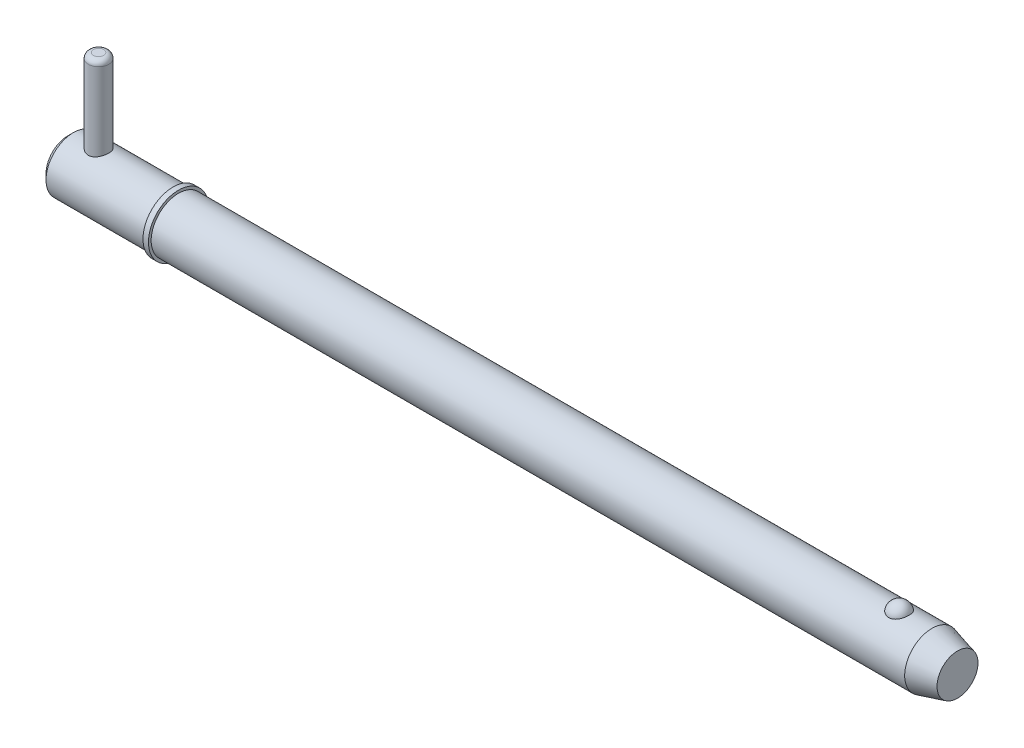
ISO-10303-21;
HEADER;
FILE_DESCRIPTION(('STEP AP214'),'2;1');
FILE_NAME('part.step','',(''),(''),'','','');
FILE_SCHEMA(('AUTOMOTIVE_DESIGN { 1 0 10303 214 1 1 1 1 }'));
ENDSEC;
DATA;
#1=APPLICATION_CONTEXT('core data for automotive mechanical design processes');
#2=APPLICATION_PROTOCOL_DEFINITION('international standard','automotive_design',2000,#1);
#3=PRODUCT_CONTEXT('',#1,'mechanical');
#4=PRODUCT('Part','Part','',(#3));
#5=PRODUCT_RELATED_PRODUCT_CATEGORY('part','',(#4));
#6=PRODUCT_DEFINITION_FORMATION('','',#4);
#7=PRODUCT_DEFINITION_CONTEXT('part definition',#1,'design');
#8=PRODUCT_DEFINITION('design','',#6,#7);
#9=PRODUCT_DEFINITION_SHAPE('','',#8);
#10=(LENGTH_UNIT() NAMED_UNIT(*) SI_UNIT(.MILLI.,.METRE.));
#11=(NAMED_UNIT(*) PLANE_ANGLE_UNIT() SI_UNIT($,.RADIAN.));
#12=(NAMED_UNIT(*) SI_UNIT($,.STERADIAN.) SOLID_ANGLE_UNIT());
#13=UNCERTAINTY_MEASURE_WITH_UNIT(LENGTH_MEASURE(1.E-05),#10,'distance_accuracy_value','');
#14=(GEOMETRIC_REPRESENTATION_CONTEXT(3) GLOBAL_UNCERTAINTY_ASSIGNED_CONTEXT((#13)) GLOBAL_UNIT_ASSIGNED_CONTEXT((#10,
#11,#12)) REPRESENTATION_CONTEXT('',''));
#15=CARTESIAN_POINT('',(0.,0.,0.));
#16=DIRECTION('',(0.,0.,1.));
#17=DIRECTION('',(1.,0.,0.));
#18=AXIS2_PLACEMENT_3D('',#15,#16,#17);
#19=CARTESIAN_POINT('',(7.14,25.4,0.));
#20=DIRECTION('',(0.,-1.,0.));
#21=DIRECTION('',(0.,0.,-1.));
#22=AXIS2_PLACEMENT_3D('',#19,#20,#21);
#23=CYLINDRICAL_SURFACE('',#22,2.38);
#24=CARTESIAN_POINT('',(7.14,-5.16,0.));
#25=DIRECTION('',(0.,1.,0.));
#26=DIRECTION('',(0.,0.,1.));
#27=AXIS2_PLACEMENT_3D('',#24,#25,#26);
#28=CIRCLE('',#27,2.38);
#29=CARTESIAN_POINT('',(7.14,-5.16,2.38));
#30=VERTEX_POINT('',#29);
#31=EDGE_CURVE('P0_E25',#30,#30,#28,.T.);
#32=ORIENTED_EDGE('',*,*,#31,.T.);
#33=EDGE_LOOP('',(#32));
#34=FACE_BOUND('',#33,.T.);
#35=CARTESIAN_POINT('',(7.14,24.21,0.));
#36=DIRECTION('',(0.,1.,0.));
#37=DIRECTION('',(0.,0.,1.));
#38=AXIS2_PLACEMENT_3D('',#35,#36,#37);
#39=CIRCLE('',#38,2.38);
#40=CARTESIAN_POINT('',(7.14,24.21,2.38));
#41=VERTEX_POINT('',#40);
#42=EDGE_CURVE('P0_E29',#41,#41,#39,.F.);
#43=ORIENTED_EDGE('',*,*,#42,.T.);
#44=EDGE_LOOP('',(#43));
#45=FACE_BOUND('',#44,.T.);
#46=ADVANCED_FACE('P0_F14',(#34,#45),#23,.T.);
#47=CARTESIAN_POINT('',(7.14,25.4,0.));
#48=DIRECTION('',(0.,1.,0.));
#49=DIRECTION('',(0.,0.,1.));
#50=AXIS2_PLACEMENT_3D('',#47,#48,#49);
#51=PLANE('',#50);
#52=CARTESIAN_POINT('',(7.14,25.4,0.));
#53=DIRECTION('',(0.,1.,0.));
#54=DIRECTION('',(0.,0.,1.));
#55=AXIS2_PLACEMENT_3D('',#52,#53,#54);
#56=CIRCLE('',#55,1.19);
#57=CARTESIAN_POINT('',(7.14,25.4,1.19));
#58=VERTEX_POINT('',#57);
#59=EDGE_CURVE('P0_E10',#58,#58,#56,.T.);
#60=ORIENTED_EDGE('',*,*,#59,.T.);
#61=EDGE_LOOP('',(#60));
#62=FACE_BOUND('',#61,.T.);
#63=ADVANCED_FACE('P0_F46',(#62),#51,.T.);
#64=CARTESIAN_POINT('',(7.14,-6.35,0.));
#65=DIRECTION('',(0.,1.,0.));
#66=DIRECTION('',(0.,0.,1.));
#67=AXIS2_PLACEMENT_3D('',#64,#65,#66);
#68=PLANE('',#67);
#69=CARTESIAN_POINT('',(7.14,-6.35,0.));
#70=DIRECTION('',(0.,1.,0.));
#71=DIRECTION('',(0.,0.,1.));
#72=AXIS2_PLACEMENT_3D('',#69,#70,#71);
#73=CIRCLE('',#72,1.19);
#74=CARTESIAN_POINT('',(7.14,-6.35,1.19));
#75=VERTEX_POINT('',#74);
#76=EDGE_CURVE('P0_E21',#75,#75,#73,.F.);
#77=ORIENTED_EDGE('',*,*,#76,.T.);
#78=EDGE_LOOP('',(#77));
#79=FACE_BOUND('',#78,.T.);
#80=ADVANCED_FACE('P0_F43',(#79),#68,.F.);
#81=CARTESIAN_POINT('',(7.14,-5.16,0.));
#82=DIRECTION('',(0.,1.,0.));
#83=DIRECTION('',(0.,0.,1.));
#84=AXIS2_PLACEMENT_3D('',#81,#82,#83);
#85=DEGENERATE_TOROIDAL_SURFACE('',#84,1.19,1.19,.T.);
#86=ORIENTED_EDGE('',*,*,#76,.F.);
#87=EDGE_LOOP('',(#86));
#88=FACE_BOUND('',#87,.T.);
#89=ORIENTED_EDGE('',*,*,#31,.F.);
#90=EDGE_LOOP('',(#89));
#91=FACE_BOUND('',#90,.T.);
#92=ADVANCED_FACE('P0_F38',(#88,#91),#85,.T.);
#93=CARTESIAN_POINT('',(7.14,24.21,0.));
#94=DIRECTION('',(0.,1.,0.));
#95=DIRECTION('',(0.,0.,1.));
#96=AXIS2_PLACEMENT_3D('',#93,#94,#95);
#97=DEGENERATE_TOROIDAL_SURFACE('',#96,1.19,1.19,.T.);
#98=ORIENTED_EDGE('',*,*,#42,.F.);
#99=EDGE_LOOP('',(#98));
#100=FACE_BOUND('',#99,.T.);
#101=ORIENTED_EDGE('',*,*,#59,.F.);
#102=EDGE_LOOP('',(#101));
#103=FACE_BOUND('',#102,.T.);
#104=ADVANCED_FACE('P0_F16',(#100,#103),#97,.T.);
#105=CLOSED_SHELL('',(#46,#63,#80,#92,#104));
#106=MANIFOLD_SOLID_BREP('P0_B1',#105);
#107=CARTESIAN_POINT('',(0.,0.,0.));
#108=DIRECTION('',(1.,0.,0.));
#109=DIRECTION('',(0.,0.,-1.));
#110=AXIS2_PLACEMENT_3D('',#107,#108,#109);
#111=CYLINDRICAL_SURFACE('',#110,6.35);
#112=CARTESIAN_POINT('',(200.755369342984,0.,0.));
#113=DIRECTION('',(1.,0.,0.));
#114=DIRECTION('',(0.,0.,-1.));
#115=AXIS2_PLACEMENT_3D('',#112,#113,#114);
#116=CIRCLE('',#115,6.35);
#117=CARTESIAN_POINT('',(200.755369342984,0.,-6.35));
#118=VERTEX_POINT('',#117);
#119=EDGE_CURVE('P1_E81',#118,#118,#116,.T.);
#120=ORIENTED_EDGE('',*,*,#119,.F.);
#121=EDGE_LOOP('',(#120));
#122=FACE_BOUND('',#121,.T.);
#123=CARTESIAN_POINT('',(25.7,0.,0.));
#124=DIRECTION('',(1.,0.,0.));
#125=DIRECTION('',(0.,0.,-1.));
#126=AXIS2_PLACEMENT_3D('',#123,#124,#125);
#127=CIRCLE('',#126,6.35);
#128=CARTESIAN_POINT('',(25.7,0.,-6.35));
#129=VERTEX_POINT('',#128);
#130=EDGE_CURVE('P1_E85',#129,#129,#127,.T.);
#131=ORIENTED_EDGE('',*,*,#130,.T.);
#132=EDGE_LOOP('',(#131));
#133=FACE_BOUND('',#132,.T.);
#134=CARTESIAN_POINT('',(193.130021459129,5.87502187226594,2.40969251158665));
#135=CARTESIAN_POINT('',(193.005030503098,5.87501645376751,2.40969773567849));
#136=CARTESIAN_POINT('',(192.880080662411,5.87916061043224,2.39967292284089));
#137=CARTESIAN_POINT('',(192.633909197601,5.89523112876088,2.35991730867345));
#138=CARTESIAN_POINT('',(192.512686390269,5.90715499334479,2.33019283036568));
#139=CARTESIAN_POINT('',(192.277517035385,5.93739567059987,2.25201402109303));
#140=CARTESIAN_POINT('',(192.163560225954,5.95570321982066,2.20358681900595));
#141=CARTESIAN_POINT('',(191.94557352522,5.9967206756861,2.08937987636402));
#142=CARTESIAN_POINT('',(191.841545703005,6.0194314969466,2.02359652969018));
#143=CARTESIAN_POINT('',(191.642943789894,6.06760647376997,1.87428969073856));
#144=CARTESIAN_POINT('',(191.548726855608,6.09313095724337,1.79031110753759));
#145=CARTESIAN_POINT('',(191.375255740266,6.14375873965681,1.60800178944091));
#146=CARTESIAN_POINT('',(191.296004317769,6.16886196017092,1.50966841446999));
#147=CARTESIAN_POINT('',(191.150845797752,6.21724600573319,1.29645884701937));
#148=CARTESIAN_POINT('',(191.085688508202,6.24039621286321,1.1810415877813));
#149=CARTESIAN_POINT('',(190.974703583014,6.28117277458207,0.940351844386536));
#150=CARTESIAN_POINT('',(190.928877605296,6.29879865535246,0.815078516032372));
#151=CARTESIAN_POINT('',(190.857023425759,6.32692073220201,0.556494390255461));
#152=CARTESIAN_POINT('',(190.831249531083,6.33732517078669,0.423102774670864));
#153=CARTESIAN_POINT('',(190.800988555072,6.34957673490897,0.153542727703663));
#154=CARTESIAN_POINT('',(190.796500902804,6.35142408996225,0.0173743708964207));
#155=CARTESIAN_POINT('',(190.808865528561,6.34638925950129,-0.253036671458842));
#156=CARTESIAN_POINT('',(190.825594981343,6.33955731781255,-0.387285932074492));
#157=CARTESIAN_POINT('',(190.879843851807,6.31794129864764,-0.650851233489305));
#158=CARTESIAN_POINT('',(190.917363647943,6.3031570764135,-0.780167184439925));
#159=CARTESIAN_POINT('',(191.012500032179,6.26711642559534,-1.03041949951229));
#160=CARTESIAN_POINT('',(191.070143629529,6.24585130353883,-1.15134433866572));
#161=CARTESIAN_POINT('',(191.204352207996,6.19905619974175,-1.38129800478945));
#162=CARTESIAN_POINT('',(191.280918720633,6.17352587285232,-1.49032586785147));
#163=CARTESIAN_POINT('',(191.451753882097,6.12080227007,-1.69393164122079));
#164=CARTESIAN_POINT('',(191.546100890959,6.09360200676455,-1.78844209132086));
#165=CARTESIAN_POINT('',(191.750119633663,6.04070434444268,-1.95970536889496));
#166=CARTESIAN_POINT('',(191.859790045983,6.015006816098,-2.0364597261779));
#167=CARTESIAN_POINT('',(192.089187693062,5.96867714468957,-2.16845644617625));
#168=CARTESIAN_POINT('',(192.208652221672,5.94794910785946,-2.22412062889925));
#169=CARTESIAN_POINT('',(192.456218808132,5.91340580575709,-2.31440992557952));
#170=CARTESIAN_POINT('',(192.584317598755,5.89958794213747,-2.34904294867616));
#171=CARTESIAN_POINT('',(192.838582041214,5.88111049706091,-2.39491590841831));
#172=CARTESIAN_POINT('',(192.964520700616,5.87602512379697,-2.40724512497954));
#173=CARTESIAN_POINT('',(193.216786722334,5.87428980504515,-2.41147867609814));
#174=CARTESIAN_POINT('',(193.343114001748,5.8776381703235,-2.40338710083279));
#175=CARTESIAN_POINT('',(193.588417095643,5.89212921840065,-2.36762715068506));
#176=CARTESIAN_POINT('',(193.707499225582,5.90302431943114,-2.3405803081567));
#177=CARTESIAN_POINT('',(193.93924472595,5.93113752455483,-2.26839066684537));
#178=CARTESIAN_POINT('',(194.051907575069,5.94835614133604,-2.22324640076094));
#179=CARTESIAN_POINT('',(194.270400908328,5.9877301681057,-2.11493806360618));
#180=CARTESIAN_POINT('',(194.376028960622,6.00998499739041,-2.05140269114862));
#181=CARTESIAN_POINT('',(194.575300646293,6.05690144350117,-1.90842705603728));
#182=CARTESIAN_POINT('',(194.668941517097,6.08156361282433,-1.82898313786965));
#183=CARTESIAN_POINT('',(194.846675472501,6.13211715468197,-1.65182429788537));
#184=CARTESIAN_POINT('',(194.930055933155,6.15800825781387,-1.5533938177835));
#185=CARTESIAN_POINT('',(195.079790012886,6.20712834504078,-1.34374214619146));
#186=CARTESIAN_POINT('',(195.146140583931,6.23035685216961,-1.23251867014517));
#187=CARTESIAN_POINT('',(195.262345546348,6.27251177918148,-0.996447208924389));
#188=CARTESIAN_POINT('',(195.311607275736,6.29127762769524,-0.871278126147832));
#189=CARTESIAN_POINT('',(195.389614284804,6.3215862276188,-0.613870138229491));
#190=CARTESIAN_POINT('',(195.418359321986,6.33312889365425,-0.481631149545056));
#191=CARTESIAN_POINT('',(195.454770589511,6.34782349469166,-0.213672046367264));
#192=CARTESIAN_POINT('',(195.462413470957,6.35096613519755,-0.0779482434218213));
#193=CARTESIAN_POINT('',(195.456395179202,6.34851322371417,0.192943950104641));
#194=CARTESIAN_POINT('',(195.442734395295,6.3429178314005,0.328112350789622));
#195=CARTESIAN_POINT('',(195.39450361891,6.32360512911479,0.593406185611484));
#196=CARTESIAN_POINT('',(195.360031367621,6.30992579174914,0.723552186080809));
#197=CARTESIAN_POINT('',(195.270953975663,6.27586325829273,0.97583417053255));
#198=CARTESIAN_POINT('',(195.21634761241,6.25547965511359,1.09796966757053));
#199=CARTESIAN_POINT('',(195.08775879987,6.20998183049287,1.33148921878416));
#200=CARTESIAN_POINT('',(195.013674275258,6.18484288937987,1.44281227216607));
#201=CARTESIAN_POINT('',(194.847820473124,6.13258735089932,1.65087683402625));
#202=CARTESIAN_POINT('',(194.756051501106,6.10547078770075,1.7476185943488));
#203=CARTESIAN_POINT('',(194.557183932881,6.05235879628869,1.92350926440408));
#204=CARTESIAN_POINT('',(194.450133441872,6.02636017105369,2.00271146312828));
#205=CARTESIAN_POINT('',(194.223138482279,5.97843747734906,2.14154159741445));
#206=CARTESIAN_POINT('',(194.103191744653,5.9565141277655,2.20116608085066));
#207=CARTESIAN_POINT('',(193.844523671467,5.91812106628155,2.30250570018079));
#208=CARTESIAN_POINT('',(193.70506980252,5.90217533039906,2.34256795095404));
#209=CARTESIAN_POINT('',(193.420397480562,5.88063128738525,2.3961521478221));
#210=CARTESIAN_POINT('',(193.27518174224,5.87502816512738,2.40968644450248));
#211=CARTESIAN_POINT('',(193.130021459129,5.87502187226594,2.40969251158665));
#212=B_SPLINE_CURVE_WITH_KNOTS('',3,(#134,#135,#136,#137,#138,#139,#140,#141,#142,#143,#144,
#145,#146,#147,#148,#149,#150,#151,#152,#153,#154,#155,#156,#157,#158,#159,#160,#161,#162,#163,
#164,#165,#166,#167,#168,#169,#170,#171,#172,#173,#174,#175,#176,#177,#178,#179,#180,#181,#182,
#183,#184,#185,#186,#187,#188,#189,#190,#191,#192,#193,#194,#195,#196,#197,#198,#199,#200,#201,
#202,#203,#204,#205,#206,#207,#208,#209,#210,#211),.UNSPECIFIED.,.T.,.F.,(4,2,2,2,2,2,2,2,2,2,2,
2,2,2,2,2,2,2,2,2,2,2,2,2,2,2,2,2,2,2,2,2,2,2,2,2,2,2,4),(0.,0.374440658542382,
0.748761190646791,1.12254078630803,1.4963981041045,1.88098871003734,2.26565013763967,
2.66741104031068,3.06920639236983,3.47601794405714,3.88281858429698,4.28727498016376,
4.69173873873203,5.09674745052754,5.50178895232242,5.90865911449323,6.31549420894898,
6.71369855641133,7.11175305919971,7.48978077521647,7.86773278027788,8.23383886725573,
8.59997464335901,8.97409044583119,9.34829231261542,9.74122667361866,10.1342313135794,
10.5397522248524,10.9452779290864,11.3512521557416,11.75721896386,12.1612938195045,
12.5653932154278,12.9716540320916,13.3779078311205,13.7829098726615,14.1879832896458,
14.6230486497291,15.0579114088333),.UNSPECIFIED.);
#213=CARTESIAN_POINT('',(193.130021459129,5.87502187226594,2.40969251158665));
#214=VERTEX_POINT('',#213);
#215=EDGE_CURVE('P1_E35',#214,#214,#212,.T.);
#216=ORIENTED_EDGE('',*,*,#215,.T.);
#217=EDGE_LOOP('',(#216));
#218=FACE_BOUND('',#217,.T.);
#219=ADVANCED_FACE('P1_F13',(#122,#133,#218),#111,.T.);
#220=CARTESIAN_POINT('',(0.,0.,0.));
#221=DIRECTION('',(-1.,0.,0.));
#222=DIRECTION('',(0.,0.,1.));
#223=AXIS2_PLACEMENT_3D('',#220,#221,#222);
#224=PLANE('',#223);
#225=CARTESIAN_POINT('',(0.,0.,0.));
#226=DIRECTION('',(1.,0.,0.));
#227=DIRECTION('',(0.,0.,-1.));
#228=AXIS2_PLACEMENT_3D('',#225,#226,#227);
#229=CIRCLE('',#228,5.08);
#230=CARTESIAN_POINT('',(0.,0.,-5.08));
#231=VERTEX_POINT('',#230);
#232=EDGE_CURVE('P1_E9',#231,#231,#229,.T.);
#233=ORIENTED_EDGE('',*,*,#232,.F.);
#234=EDGE_LOOP('',(#233));
#235=FACE_BOUND('',#234,.T.);
#236=ADVANCED_FACE('P1_F15',(#235),#224,.T.);
#237=CARTESIAN_POINT('',(1.27,0.,0.));
#238=DIRECTION('',(1.,0.,0.));
#239=DIRECTION('',(0.,0.,-1.));
#240=AXIS2_PLACEMENT_3D('',#237,#238,#239);
#241=CONICAL_SURFACE('',#240,6.35,0.78539816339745);
#242=ORIENTED_EDGE('',*,*,#232,.T.);
#243=EDGE_LOOP('',(#242));
#244=FACE_BOUND('',#243,.T.);
#245=CARTESIAN_POINT('',(1.27,0.,0.));
#246=DIRECTION('',(1.,0.,0.));
#247=DIRECTION('',(0.,0.,-1.));
#248=AXIS2_PLACEMENT_3D('',#245,#246,#247);
#249=CIRCLE('',#248,6.35);
#250=CARTESIAN_POINT('',(1.27,0.,-6.35));
#251=VERTEX_POINT('',#250);
#252=EDGE_CURVE('P1_E26',#251,#251,#249,.T.);
#253=ORIENTED_EDGE('',*,*,#252,.F.);
#254=EDGE_LOOP('',(#253));
#255=FACE_BOUND('',#254,.T.);
#256=ADVANCED_FACE('P1_F77',(#244,#255),#241,.T.);
#257=CARTESIAN_POINT('',(0.,0.,0.));
#258=DIRECTION('',(1.,0.,0.));
#259=DIRECTION('',(0.,0.,-1.));
#260=AXIS2_PLACEMENT_3D('',#257,#258,#259);
#261=CYLINDRICAL_SURFACE('',#260,6.35);
#262=CARTESIAN_POINT('',(7.14,-5.88711304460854,2.38));
#263=CARTESIAN_POINT('',(7.01146258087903,-5.88710856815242,2.38000480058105));
#264=CARTESIAN_POINT('',(6.88295682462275,-5.89136840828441,2.36955244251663));
#265=CARTESIAN_POINT('',(6.62981934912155,-5.90782785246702,2.32820953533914));
#266=CARTESIAN_POINT('',(6.50518751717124,-5.92002722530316,2.29731958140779));
#267=CARTESIAN_POINT('',(6.26352403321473,-5.95079384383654,2.21639366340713));
#268=CARTESIAN_POINT('',(6.14647496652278,-5.96934583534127,2.16640353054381));
#269=CARTESIAN_POINT('',(5.92237941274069,-6.01070278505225,2.04885862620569));
#270=CARTESIAN_POINT('',(5.81533593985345,-6.03350901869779,1.98129858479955));
#271=CARTESIAN_POINT('',(5.60897525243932,-6.08207341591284,1.82693902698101));
#272=CARTESIAN_POINT('',(5.51022503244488,-6.10791836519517,1.73940861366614));
#273=CARTESIAN_POINT('',(5.32840561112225,-6.15892405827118,1.54914379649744));
#274=CARTESIAN_POINT('',(5.24533975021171,-6.1840846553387,1.44640616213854));
#275=CARTESIAN_POINT('',(5.09451639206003,-6.23191821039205,1.22434014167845));
#276=CARTESIAN_POINT('',(5.02737511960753,-6.25447755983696,1.10456656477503));
#277=CARTESIAN_POINT('',(4.91443001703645,-6.2935236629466,0.854429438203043));
#278=CARTESIAN_POINT('',(4.86861879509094,-6.31001251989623,0.724069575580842));
#279=CARTESIAN_POINT('',(4.80162253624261,-6.33444370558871,0.46242122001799));
#280=CARTESIAN_POINT('',(4.77946137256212,-6.34272370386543,0.331414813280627));
#281=CARTESIAN_POINT('',(4.75726677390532,-6.35101600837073,0.0672982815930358));
#282=CARTESIAN_POINT('',(4.75722615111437,-6.35103100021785,-0.0658111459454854));
#283=CARTESIAN_POINT('',(4.77870510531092,-6.3430064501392,-0.323358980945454));
#284=CARTESIAN_POINT('',(4.79915922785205,-6.33536494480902,-0.447900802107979));
#285=CARTESIAN_POINT('',(4.85925493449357,-6.31340794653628,-0.69163609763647));
#286=CARTESIAN_POINT('',(4.89889787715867,-6.29909198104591,-0.810829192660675));
#287=CARTESIAN_POINT('',(4.9967414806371,-6.26494471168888,-1.04254212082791));
#288=CARTESIAN_POINT('',(5.05520370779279,-6.24503620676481,-1.1549396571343));
#289=CARTESIAN_POINT('',(5.1887948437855,-6.20171869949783,-1.3686079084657));
#290=CARTESIAN_POINT('',(5.26392912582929,-6.17830856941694,-1.46987502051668));
#291=CARTESIAN_POINT('',(5.43386591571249,-6.12878580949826,-1.66468415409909));
#292=CARTESIAN_POINT('',(5.52956139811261,-6.10259519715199,-1.75742857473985));
#293=CARTESIAN_POINT('',(5.73530435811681,-6.05155777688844,-1.92585331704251));
#294=CARTESIAN_POINT('',(5.84535542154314,-6.02671130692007,-2.00152936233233));
#295=CARTESIAN_POINT('',(6.07982989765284,-5.98068420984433,-2.13519109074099));
#296=CARTESIAN_POINT('',(6.20451768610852,-5.95959698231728,-2.19274775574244));
#297=CARTESIAN_POINT('',(6.4628145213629,-5.92455622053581,-2.28574558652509));
#298=CARTESIAN_POINT('',(6.59641856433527,-5.91059872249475,-2.32119904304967));
#299=CARTESIAN_POINT('',(6.86087441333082,-5.8923327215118,-2.36717069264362));
#300=CARTESIAN_POINT('',(6.99147192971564,-5.8875347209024,-2.37895573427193));
#301=CARTESIAN_POINT('',(7.25283805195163,-5.88674545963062,-2.38091046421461));
#302=CARTESIAN_POINT('',(7.38360660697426,-5.89075200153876,-2.37108554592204));
#303=CARTESIAN_POINT('',(7.63510696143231,-5.90662331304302,-2.33124781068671));
#304=CARTESIAN_POINT('',(7.75602069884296,-5.91810660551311,-2.30221396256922));
#305=CARTESIAN_POINT('',(7.99120505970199,-5.94718527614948,-2.22601401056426));
#306=CARTESIAN_POINT('',(8.10547431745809,-5.96478190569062,-2.17884419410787));
#307=CARTESIAN_POINT('',(8.32888632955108,-6.00491533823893,-2.06572311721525));
#308=CARTESIAN_POINT('',(8.43767672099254,-6.02761250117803,-1.99913452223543));
#309=CARTESIAN_POINT('',(8.6429894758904,-6.07511988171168,-1.84974438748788));
#310=CARTESIAN_POINT('',(8.73950733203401,-6.09993087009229,-1.76693691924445));
#311=CARTESIAN_POINT('',(8.9238741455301,-6.1507686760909,-1.58125563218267));
#312=CARTESIAN_POINT('',(9.01078732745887,-6.17677301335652,-1.47744327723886));
#313=CARTESIAN_POINT('',(9.16607127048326,-6.22556172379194,-1.25606967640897));
#314=CARTESIAN_POINT('',(9.23444197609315,-6.24834608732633,-1.13850838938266));
#315=CARTESIAN_POINT('',(9.3502493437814,-6.28811144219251,-0.893050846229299));
#316=CARTESIAN_POINT('',(9.39775808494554,-6.30511236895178,-0.765192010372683));
#317=CARTESIAN_POINT('',(9.47032640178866,-6.33145833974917,-0.502514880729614));
#318=CARTESIAN_POINT('',(9.49539651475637,-6.34080697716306,-0.367699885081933));
#319=CARTESIAN_POINT('',(9.52124059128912,-6.35045496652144,-0.103396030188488));
#320=CARTESIAN_POINT('',(9.52334421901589,-6.35124952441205,0.025945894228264));
#321=CARTESIAN_POINT('',(9.50661518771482,-6.34499064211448,0.283061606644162));
#322=CARTESIAN_POINT('',(9.48778504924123,-6.33793814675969,0.410835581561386));
#323=CARTESIAN_POINT('',(9.43065630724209,-6.31700307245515,0.658028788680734));
#324=CARTESIAN_POINT('',(9.39284291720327,-6.30329098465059,0.7775756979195));
#325=CARTESIAN_POINT('',(9.29930406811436,-6.27046903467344,1.00863789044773));
#326=CARTESIAN_POINT('',(9.2435752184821,-6.25135815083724,1.12015164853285));
#327=CARTESIAN_POINT('',(9.11312349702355,-6.20865254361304,1.33711407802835));
#328=CARTESIAN_POINT('',(9.03770094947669,-6.18490316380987,1.44211105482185));
#329=CARTESIAN_POINT('',(8.87110640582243,-6.13583718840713,1.63836897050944));
#330=CARTESIAN_POINT('',(8.77992879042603,-6.11052003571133,1.72962498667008));
#331=CARTESIAN_POINT('',(8.57869799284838,-6.05953829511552,1.90076098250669));
#332=CARTESIAN_POINT('',(8.46790320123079,-6.03392573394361,1.97978778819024));
#333=CARTESIAN_POINT('',(8.23379693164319,-5.98676607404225,2.11813466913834));
#334=CARTESIAN_POINT('',(8.11048418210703,-5.9652193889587,2.17745273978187));
#335=CARTESIAN_POINT('',(7.84900037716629,-5.92818393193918,2.27641807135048));
#336=CARTESIAN_POINT('',(7.71041678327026,-5.91299857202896,2.31510015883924));
#337=CARTESIAN_POINT('',(7.42787316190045,-5.89246887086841,2.36688002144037));
#338=CARTESIAN_POINT('',(7.28391673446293,-5.88711805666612,2.37999462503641));
#339=CARTESIAN_POINT('',(7.14,-5.88711304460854,2.38));
#340=B_SPLINE_CURVE_WITH_KNOTS('',3,(#262,#263,#264,#265,#266,#267,#268,#269,#270,#271,#272,
#273,#274,#275,#276,#277,#278,#279,#280,#281,#282,#283,#284,#285,#286,#287,#288,#289,#290,#291,
#292,#293,#294,#295,#296,#297,#298,#299,#300,#301,#302,#303,#304,#305,#306,#307,#308,#309,#310,
#311,#312,#313,#314,#315,#316,#317,#318,#319,#320,#321,#322,#323,#324,#325,#326,#327,#328,#329,
#330,#331,#332,#333,#334,#335,#336,#337,#338,#339),.UNSPECIFIED.,.T.,.F.,(4,2,2,2,2,2,2,2,2,2,2,
2,2,2,2,2,2,2,2,2,2,2,2,2,2,2,2,2,2,2,2,2,2,2,2,2,2,2,4),(0.,0.385076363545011,
0.770141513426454,1.15428843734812,1.53855071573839,1.94016118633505,2.3418570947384,
2.75720522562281,3.1724093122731,3.569721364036,3.96690431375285,4.34445758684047,
4.72203759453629,5.10511017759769,5.48830640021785,5.89390240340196,6.29959991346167,
6.71428455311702,7.12873839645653,7.52034494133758,7.91185376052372,8.28480528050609,
8.65783318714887,9.0448340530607,9.43197664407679,9.84363087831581,10.2552863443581,
10.6655081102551,11.0755371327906,11.4616919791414,11.847800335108,12.224507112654,
12.6012852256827,12.9938941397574,13.386643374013,13.8000944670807,14.2135876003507,
14.6450218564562,15.0761720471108),.UNSPECIFIED.);
#341=CARTESIAN_POINT('',(7.14,-5.88711304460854,2.38));
#342=VERTEX_POINT('',#341);
#343=EDGE_CURVE('P1_E17',#342,#342,#340,.T.);
#344=ORIENTED_EDGE('',*,*,#343,.F.);
#345=EDGE_LOOP('',(#344));
#346=FACE_BOUND('',#345,.T.);
#347=CARTESIAN_POINT('',(7.14,5.88711304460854,2.38));
#348=CARTESIAN_POINT('',(7.26853741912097,5.88710856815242,2.38000480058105));
#349=CARTESIAN_POINT('',(7.39704317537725,5.89136840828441,2.36955244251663));
#350=CARTESIAN_POINT('',(7.65018065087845,5.90782785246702,2.32820953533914));
#351=CARTESIAN_POINT('',(7.77481248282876,5.92002722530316,2.29731958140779));
#352=CARTESIAN_POINT('',(8.01647596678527,5.95079384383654,2.21639366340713));
#353=CARTESIAN_POINT('',(8.13352503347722,5.96934583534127,2.16640353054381));
#354=CARTESIAN_POINT('',(8.35762058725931,6.01070278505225,2.04885862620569));
#355=CARTESIAN_POINT('',(8.46466406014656,6.03350901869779,1.98129858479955));
#356=CARTESIAN_POINT('',(8.67102474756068,6.08207341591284,1.82693902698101));
#357=CARTESIAN_POINT('',(8.76977496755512,6.10791836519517,1.73940861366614));
#358=CARTESIAN_POINT('',(8.95159438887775,6.15892405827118,1.54914379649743));
#359=CARTESIAN_POINT('',(9.03466024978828,6.1840846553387,1.44640616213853));
#360=CARTESIAN_POINT('',(9.18548360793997,6.23191821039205,1.22434014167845));
#361=CARTESIAN_POINT('',(9.25262488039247,6.25447755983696,1.10456656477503));
#362=CARTESIAN_POINT('',(9.36556998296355,6.2935236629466,0.854429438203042));
#363=CARTESIAN_POINT('',(9.41138120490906,6.31001251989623,0.72406957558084));
#364=CARTESIAN_POINT('',(9.47837746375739,6.33444370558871,0.462421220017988));
#365=CARTESIAN_POINT('',(9.50053862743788,6.34272370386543,0.331414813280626));
#366=CARTESIAN_POINT('',(9.52273322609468,6.35101600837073,0.0672982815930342));
#367=CARTESIAN_POINT('',(9.52277384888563,6.35103100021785,-0.0658111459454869));
#368=CARTESIAN_POINT('',(9.50129489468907,6.3430064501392,-0.323358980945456));
#369=CARTESIAN_POINT('',(9.48084077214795,6.33536494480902,-0.447900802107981));
#370=CARTESIAN_POINT('',(9.42074506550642,6.31340794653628,-0.691636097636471));
#371=CARTESIAN_POINT('',(9.38110212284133,6.29909198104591,-0.810829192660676));
#372=CARTESIAN_POINT('',(9.2832585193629,6.26494471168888,-1.04254212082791));
#373=CARTESIAN_POINT('',(9.22479629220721,6.24503620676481,-1.1549396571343));
#374=CARTESIAN_POINT('',(9.0912051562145,6.20171869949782,-1.3686079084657));
#375=CARTESIAN_POINT('',(9.0160708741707,6.17830856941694,-1.46987502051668));
#376=CARTESIAN_POINT('',(8.84613408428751,6.12878580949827,-1.66468415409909));
#377=CARTESIAN_POINT('',(8.75043860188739,6.10259519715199,-1.75742857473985));
#378=CARTESIAN_POINT('',(8.54469564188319,6.05155777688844,-1.92585331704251));
#379=CARTESIAN_POINT('',(8.43464457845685,6.02671130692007,-2.00152936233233));
#380=CARTESIAN_POINT('',(8.20017010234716,5.98068420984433,-2.13519109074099));
#381=CARTESIAN_POINT('',(8.07548231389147,5.95959698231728,-2.19274775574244));
#382=CARTESIAN_POINT('',(7.8171854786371,5.9245562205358,-2.28574558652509));
#383=CARTESIAN_POINT('',(7.68358143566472,5.91059872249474,-2.32119904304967));
#384=CARTESIAN_POINT('',(7.41912558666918,5.8923327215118,-2.36717069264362));
#385=CARTESIAN_POINT('',(7.28852807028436,5.8875347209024,-2.37895573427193));
#386=CARTESIAN_POINT('',(7.02716194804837,5.88674545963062,-2.38091046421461));
#387=CARTESIAN_POINT('',(6.89639339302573,5.89075200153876,-2.37108554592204));
#388=CARTESIAN_POINT('',(6.64489303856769,5.90662331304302,-2.33124781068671));
#389=CARTESIAN_POINT('',(6.52397930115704,5.91810660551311,-2.30221396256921));
#390=CARTESIAN_POINT('',(6.288794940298,5.94718527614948,-2.22601401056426));
#391=CARTESIAN_POINT('',(6.17452568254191,5.96478190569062,-2.17884419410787));
#392=CARTESIAN_POINT('',(5.95111367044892,6.00491533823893,-2.06572311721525));
#393=CARTESIAN_POINT('',(5.84232327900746,6.02761250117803,-1.99913452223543));
#394=CARTESIAN_POINT('',(5.6370105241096,6.07511988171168,-1.84974438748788));
#395=CARTESIAN_POINT('',(5.54049266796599,6.09993087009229,-1.76693691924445));
#396=CARTESIAN_POINT('',(5.3561258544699,6.1507686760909,-1.58125563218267));
#397=CARTESIAN_POINT('',(5.26921267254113,6.17677301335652,-1.47744327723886));
#398=CARTESIAN_POINT('',(5.11392872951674,6.22556172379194,-1.25606967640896));
#399=CARTESIAN_POINT('',(5.04555802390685,6.24834608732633,-1.13850838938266));
#400=CARTESIAN_POINT('',(4.9297506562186,6.28811144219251,-0.893050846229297));
#401=CARTESIAN_POINT('',(4.88224191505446,6.30511236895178,-0.76519201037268));
#402=CARTESIAN_POINT('',(4.80967359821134,6.33145833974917,-0.502514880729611));
#403=CARTESIAN_POINT('',(4.78460348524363,6.34080697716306,-0.36769988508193));
#404=CARTESIAN_POINT('',(4.75875940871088,6.35045496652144,-0.103396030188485));
#405=CARTESIAN_POINT('',(4.75665578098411,6.35124952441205,0.025945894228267));
#406=CARTESIAN_POINT('',(4.77338481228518,6.34499064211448,0.283061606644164));
#407=CARTESIAN_POINT('',(4.79221495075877,6.33793814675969,0.410835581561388));
#408=CARTESIAN_POINT('',(4.84934369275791,6.31700307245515,0.658028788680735));
#409=CARTESIAN_POINT('',(4.88715708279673,6.30329098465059,0.777575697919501));
#410=CARTESIAN_POINT('',(4.98069593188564,6.27046903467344,1.00863789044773));
#411=CARTESIAN_POINT('',(5.0364247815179,6.25135815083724,1.12015164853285));
#412=CARTESIAN_POINT('',(5.16687650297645,6.20865254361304,1.33711407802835));
#413=CARTESIAN_POINT('',(5.24229905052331,6.18490316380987,1.44211105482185));
#414=CARTESIAN_POINT('',(5.40889359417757,6.13583718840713,1.63836897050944));
#415=CARTESIAN_POINT('',(5.50007120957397,6.11052003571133,1.72962498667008));
#416=CARTESIAN_POINT('',(5.70130200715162,6.05953829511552,1.90076098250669));
#417=CARTESIAN_POINT('',(5.81209679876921,6.03392573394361,1.97978778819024));
#418=CARTESIAN_POINT('',(6.04620306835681,5.98676607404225,2.11813466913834));
#419=CARTESIAN_POINT('',(6.16951581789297,5.9652193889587,2.17745273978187));
#420=CARTESIAN_POINT('',(6.43099962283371,5.92818393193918,2.27641807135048));
#421=CARTESIAN_POINT('',(6.56958321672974,5.91299857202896,2.31510015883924));
#422=CARTESIAN_POINT('',(6.85212683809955,5.89246887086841,2.36688002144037));
#423=CARTESIAN_POINT('',(6.99608326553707,5.88711805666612,2.37999462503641));
#424=CARTESIAN_POINT('',(7.14,5.88711304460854,2.38));
#425=B_SPLINE_CURVE_WITH_KNOTS('',3,(#347,#348,#349,#350,#351,#352,#353,#354,#355,#356,#357,
#358,#359,#360,#361,#362,#363,#364,#365,#366,#367,#368,#369,#370,#371,#372,#373,#374,#375,#376,
#377,#378,#379,#380,#381,#382,#383,#384,#385,#386,#387,#388,#389,#390,#391,#392,#393,#394,#395,
#396,#397,#398,#399,#400,#401,#402,#403,#404,#405,#406,#407,#408,#409,#410,#411,#412,#413,#414,
#415,#416,#417,#418,#419,#420,#421,#422,#423,#424),.UNSPECIFIED.,.T.,.F.,(4,2,2,2,2,2,2,2,2,2,2,
2,2,2,2,2,2,2,2,2,2,2,2,2,2,2,2,2,2,2,2,2,2,2,2,2,2,2,4),(0.,0.385076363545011,
0.770141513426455,1.15428843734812,1.53855071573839,1.94016118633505,2.3418570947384,
2.75720522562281,3.1724093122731,3.56972136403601,3.96690431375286,4.34445758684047,
4.72203759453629,5.10511017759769,5.48830640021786,5.89390240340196,6.29959991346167,
6.71428455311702,7.12873839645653,7.52034494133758,7.91185376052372,8.2848052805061,
8.65783318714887,9.0448340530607,9.43197664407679,9.84363087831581,10.2552863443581,
10.6655081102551,11.0755371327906,11.4616919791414,11.847800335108,12.2245071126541,
12.6012852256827,12.9938941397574,13.386643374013,13.8000944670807,14.2135876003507,
14.6450218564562,15.0761720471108),.UNSPECIFIED.);
#426=CARTESIAN_POINT('',(7.14,5.88711304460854,2.38));
#427=VERTEX_POINT('',#426);
#428=EDGE_CURVE('P1_E43',#427,#427,#425,.T.);
#429=ORIENTED_EDGE('',*,*,#428,.F.);
#430=EDGE_LOOP('',(#429));
#431=FACE_BOUND('',#430,.T.);
#432=ORIENTED_EDGE('',*,*,#252,.T.);
#433=EDGE_LOOP('',(#432));
#434=FACE_BOUND('',#433,.T.);
#435=CARTESIAN_POINT('',(24.43,0.,0.));
#436=DIRECTION('',(1.,0.,0.));
#437=DIRECTION('',(0.,0.,-1.));
#438=AXIS2_PLACEMENT_3D('',#435,#436,#437);
#439=CIRCLE('',#438,6.35);
#440=CARTESIAN_POINT('',(24.43,0.,-6.35));
#441=VERTEX_POINT('',#440);
#442=EDGE_CURVE('P1_E31',#441,#441,#439,.T.);
#443=ORIENTED_EDGE('',*,*,#442,.F.);
#444=EDGE_LOOP('',(#443));
#445=FACE_BOUND('',#444,.T.);
#446=ADVANCED_FACE('P1_F103',(#346,#431,#434,#445),#261,.T.);
#447=CARTESIAN_POINT('',(24.43,6.35,0.));
#448=DIRECTION('',(-1.,0.,0.));
#449=DIRECTION('',(0.,0.,1.));
#450=AXIS2_PLACEMENT_3D('',#447,#448,#449);
#451=PLANE('',#450);
#452=ORIENTED_EDGE('',*,*,#442,.T.);
#453=EDGE_LOOP('',(#452));
#454=FACE_BOUND('',#453,.T.);
#455=CARTESIAN_POINT('',(24.43,0.,0.));
#456=DIRECTION('',(1.,0.,0.));
#457=DIRECTION('',(0.,0.,-1.));
#458=AXIS2_PLACEMENT_3D('',#455,#456,#457);
#459=CIRCLE('',#458,6.985);
#460=CARTESIAN_POINT('',(24.43,0.,-6.985));
#461=VERTEX_POINT('',#460);
#462=EDGE_CURVE('P1_E91',#461,#461,#459,.T.);
#463=ORIENTED_EDGE('',*,*,#462,.F.);
#464=EDGE_LOOP('',(#463));
#465=FACE_BOUND('',#464,.T.);
#466=ADVANCED_FACE('P1_F100',(#454,#465),#451,.T.);
#467=CARTESIAN_POINT('',(0.,0.,0.));
#468=DIRECTION('',(1.,0.,0.));
#469=DIRECTION('',(0.,0.,-1.));
#470=AXIS2_PLACEMENT_3D('',#467,#468,#469);
#471=CYLINDRICAL_SURFACE('',#470,6.985);
#472=ORIENTED_EDGE('',*,*,#462,.T.);
#473=EDGE_LOOP('',(#472));
#474=FACE_BOUND('',#473,.T.);
#475=CARTESIAN_POINT('',(25.7,0.,0.));
#476=DIRECTION('',(1.,0.,0.));
#477=DIRECTION('',(0.,0.,-1.));
#478=AXIS2_PLACEMENT_3D('',#475,#476,#477);
#479=CIRCLE('',#478,6.985);
#480=CARTESIAN_POINT('',(25.7,0.,-6.985));
#481=VERTEX_POINT('',#480);
#482=EDGE_CURVE('P1_E88',#481,#481,#479,.T.);
#483=ORIENTED_EDGE('',*,*,#482,.F.);
#484=EDGE_LOOP('',(#483));
#485=FACE_BOUND('',#484,.T.);
#486=ADVANCED_FACE('P1_F68',(#474,#485),#471,.T.);
#487=CARTESIAN_POINT('',(25.7,6.985,0.));
#488=DIRECTION('',(1.,0.,0.));
#489=DIRECTION('',(0.,0.,-1.));
#490=AXIS2_PLACEMENT_3D('',#487,#488,#489);
#491=PLANE('',#490);
#492=ORIENTED_EDGE('',*,*,#482,.T.);
#493=EDGE_LOOP('',(#492));
#494=FACE_BOUND('',#493,.T.);
#495=ORIENTED_EDGE('',*,*,#130,.F.);
#496=EDGE_LOOP('',(#495));
#497=FACE_BOUND('',#496,.T.);
#498=ADVANCED_FACE('P1_F62',(#494,#497),#491,.T.);
#499=CARTESIAN_POINT('',(206.68,0.,0.));
#500=DIRECTION('',(-1.,0.,0.));
#501=DIRECTION('',(0.,0.,1.));
#502=AXIS2_PLACEMENT_3D('',#499,#500,#501);
#503=CONICAL_SURFACE('',#502,4.76250000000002,0.26179938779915);
#504=ORIENTED_EDGE('',*,*,#119,.T.);
#505=EDGE_LOOP('',(#504));
#506=FACE_BOUND('',#505,.T.);
#507=CARTESIAN_POINT('',(206.68,0.,0.));
#508=DIRECTION('',(1.,0.,0.));
#509=DIRECTION('',(0.,0.,-1.));
#510=AXIS2_PLACEMENT_3D('',#507,#508,#509);
#511=CIRCLE('',#510,4.76250000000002);
#512=CARTESIAN_POINT('',(206.68,0.,-4.76250000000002));
#513=VERTEX_POINT('',#512);
#514=EDGE_CURVE('P1_E42',#513,#513,#511,.T.);
#515=ORIENTED_EDGE('',*,*,#514,.F.);
#516=EDGE_LOOP('',(#515));
#517=FACE_BOUND('',#516,.T.);
#518=ADVANCED_FACE('P1_F59',(#506,#517),#503,.T.);
#519=CARTESIAN_POINT('',(206.68,4.76250000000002,0.));
#520=DIRECTION('',(1.,0.,0.));
#521=DIRECTION('',(0.,0.,-1.));
#522=AXIS2_PLACEMENT_3D('',#519,#520,#521);
#523=PLANE('',#522);
#524=ORIENTED_EDGE('',*,*,#514,.T.);
#525=EDGE_LOOP('',(#524));
#526=FACE_BOUND('',#525,.T.);
#527=ADVANCED_FACE('P1_F55',(#526),#523,.T.);
#528=CARTESIAN_POINT('',(193.130021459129,5.715,0.));
#529=DIRECTION('',(-1.,0.,0.));
#530=DIRECTION('',(0.,1.,0.));
#531=AXIS2_PLACEMENT_3D('',#528,#529,#530);
#532=SPHERICAL_SURFACE('',#531,2.41500000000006);
#533=ORIENTED_EDGE('',*,*,#215,.F.);
#534=EDGE_LOOP('',(#533));
#535=FACE_BOUND('',#534,.T.);
#536=ADVANCED_FACE('P1_F50',(#535),#532,.T.);
#537=CARTESIAN_POINT('',(7.14,-6.985,0.));
#538=DIRECTION('',(0.,1.,0.));
#539=DIRECTION('',(0.,0.,1.));
#540=AXIS2_PLACEMENT_3D('',#537,#538,#539);
#541=CYLINDRICAL_SURFACE('',#540,2.38);
#542=ORIENTED_EDGE('',*,*,#343,.T.);
#543=EDGE_LOOP('',(#542));
#544=FACE_BOUND('',#543,.T.);
#545=ORIENTED_EDGE('',*,*,#428,.T.);
#546=EDGE_LOOP('',(#545));
#547=FACE_BOUND('',#546,.T.);
#548=ADVANCED_FACE('P1_F54',(#544,#547),#541,.F.);
#549=CLOSED_SHELL('',(#219,#236,#256,#446,#466,#486,#498,#518,#527,#536,#548));
#550=MANIFOLD_SOLID_BREP('P1_B1',#549);
#551=ADVANCED_BREP_SHAPE_REPRESENTATION('',(#18,#106,#550),#14);
#552=SHAPE_DEFINITION_REPRESENTATION(#9,#551);
ENDSEC;
END-ISO-10303-21;
